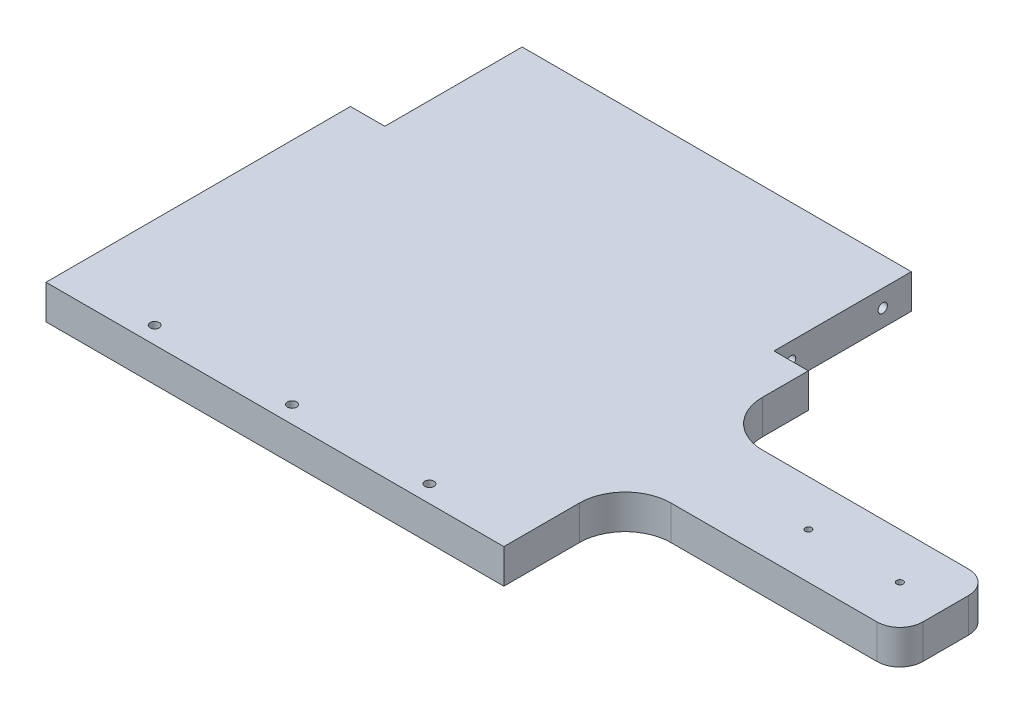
from build123d import *

# Parameters (mm, degrees)
SKETCH1_W                      = 254
SKETCH1_H                      = 245.11
SKETCH1_W_2                    = 152.4
SKETCH1_H_2                    = 50.8
BOSS_EXTRUDE1_DEPTH            = 19.05
SKETCH2_R                      = 1.778
CUT_EXTRUDE1_DEPTH             = 306.691004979
FILLET1_R                      = 25.4
FILLET2_R                      = 25.4
FILLET3_R                      = 12.7
FILLET4_R                      = 12.7
SKETCH3_W                      = 76.2
SKETCH3_H                      = 19.05
CUT_EXTRUDE2_DEPTH             = 19.05
F_10_CLEARANCE_HOLE1_D         = 5.1054
F_10_CLEARANCE_HOLE2_D         = 5.1054
SKETCH8_W                      = 76.2
SKETCH8_H                      = 19.05
CUT_EXTRUDE3_DEPTH             = 19.05
F_7_0_201_DIAMETER_HOLE5_D     = 5.1054
F_7_0_201_DIAMETER_HOLE5_DEPTH = 50.8
F_7_0_201_DIAMETER_HOLE5_TIP   = 1.533816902


with BuildPart() as part:
    # Sketch1 → Boss-Extrude1 (new body)
    with BuildSketch(Plane(origin=(0, 0, 0), x_dir=(1, 0, 0), z_dir=(0, 1, 0))):
        Rectangle(SKETCH1_W, SKETCH1_H)
        with Locations((203.2, -29.845)):
            Rectangle(SKETCH1_W_2, SKETCH1_H_2)
    extrude(amount=BOSS_EXTRUDE1_DEPTH)

    # Sketch2 → Cut-Extrude1 (cut, through all)
    with BuildSketch(Plane(origin=(0, 19.05, 0), x_dir=(1, 0, 0), z_dir=(0, 1, 0))):
        with Locations(Location((203.2, -29.845, 0), (0, 0, 270))):
            Circle(SKETCH2_R)
        with Locations(Location((254, -29.845, 0), (0, 0, 270))):
            Circle(SKETCH2_R)
    extrude(amount=-CUT_EXTRUDE1_DEPTH, mode=Mode.SUBTRACT)

    # Fillet1
    fillet1_edges = [part.edges().sort_by_distance(p)[0] for p in [
        (127, 9.525, 4.445),
    ]]
    fillet(fillet1_edges, radius=FILLET1_R)

    # Fillet2
    fillet2_edges = [part.edges().sort_by_distance(p)[0] for p in [
        (127, 9.525, 55.245),
    ]]
    fillet(fillet2_edges, radius=FILLET2_R)

    # Fillet3
    fillet3_edges = [part.edges().sort_by_distance(p)[0] for p in [
        (279.4, 9.525, 4.445),
    ]]
    fillet(fillet3_edges, radius=FILLET3_R)

    # Fillet4
    fillet4_edges = [part.edges().sort_by_distance(p)[0] for p in [
        (279.4, 9.525, 55.245),
    ]]
    fillet(fillet4_edges, radius=FILLET4_R)

    # Sketch3 → Cut-Extrude2 (cut)
    with BuildSketch(Plane.ZY.offset(127)):
        with Locations((-84.455, 9.525)):
            Rectangle(SKETCH3_W, SKETCH3_H)
    extrude(amount=-CUT_EXTRUDE2_DEPTH, mode=Mode.SUBTRACT)

    # 10 Clearance Hole1 (through all)
    with Locations(Plane(origin=(0, 19.05, 0), x_dir=(1, 0, 0), z_dir=(0, 1, 0))):
        with Locations((-76.2, -113.03)):
            f_10_clearance_hole1 = Hole(F_10_CLEARANCE_HOLE1_D / 2)

    # Mirror1: 10 Clearance Hole1 across plane
    add(f_10_clearance_hole1.mirror(Plane(origin=(0, 0, 0), x_dir=(0, 0, 1), z_dir=(1, 0, 0))), mode=Mode.SUBTRACT)

    # 10 Clearance Hole2 (through all)
    with Locations(Plane(origin=(0, 19.05, 0), x_dir=(1, 0, 0), z_dir=(0, 1, 0))):
        with Locations((0, -113.03)):
            Hole(F_10_CLEARANCE_HOLE2_D / 2)

    # Sketch8 → Cut-Extrude3 (cut)
    with BuildSketch(Plane(origin=(127, 0, 0), x_dir=(0, 0, -1), z_dir=(1, 0, 0))):
        with Locations((84.455, 9.525)):
            Rectangle(SKETCH8_W, SKETCH8_H)
    extrude(amount=-CUT_EXTRUDE3_DEPTH, mode=Mode.SUBTRACT)

    # Sketch9 → 7 _0.201_ Diameter Hole1 (revolve, cut)
    with BuildSketch(Plane(origin=(107.95, 9.525, -55.88), x_dir=(0, 0, -1), z_dir=(0, 1, 0))):
        Polygon((0, 0), (0, 52.333816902), (2.5527, 50.8), (2.5527, 0), align=None)
    f_7_0_201_diameter_hole1 = revolve(axis=Axis((114.3, 9.525, -55.88), (-1, 0, 0)), mode=Mode.SUBTRACT)

    # Sketch11 → 7 _0.201_ Diameter Hole2 (revolve, cut)
    with BuildSketch(Plane(origin=(107.95, 9.525, -106.68), x_dir=(0, 0, -1), z_dir=(0, 1, 0))):
        Polygon((0, 0), (0, 52.333816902), (2.5527, 50.8), (2.5527, 0), align=None)
    f_7_0_201_diameter_hole2 = revolve(axis=Axis((114.3, 9.525, -106.68), (-1, 0, 0)), mode=Mode.SUBTRACT)

    # Mirror2: 7 _0.201_ Diameter Hole1, 7 _0.201_ Diameter Hole2 across plane
    add(f_7_0_201_diameter_hole1.mirror(Plane(origin=(0, 0, 0), x_dir=(0, 0, 1), z_dir=(1, 0, 0))), mode=Mode.SUBTRACT)
    add(f_7_0_201_diameter_hole2.mirror(Plane(origin=(0, 0, 0), x_dir=(0, 0, 1), z_dir=(1, 0, 0))), mode=Mode.SUBTRACT)

    # Sketch13 → 7 _0.201_ Diameter Hole3 (revolve, cut)
    with BuildSketch(Plane(origin=(-63.5, 9.525, -122.555), x_dir=(0, 1, 0), z_dir=(1, 0, 0))):
        Polygon((0, 0), (0, 52.333816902), (2.5527, 50.8), (2.5527, 0), align=None)
    f_7_0_201_diameter_hole3 = revolve(axis=Axis((-63.5, 9.525, -128.905), (0, 0, 1)), mode=Mode.SUBTRACT)

    # Mirror3: 7 _0.201_ Diameter Hole3 across plane
    add(f_7_0_201_diameter_hole3.mirror(Plane(origin=(0, 0, 0), x_dir=(0, 0, 1), z_dir=(1, 0, 0))), mode=Mode.SUBTRACT)

    # 7 _0.201_ Diameter Hole5
    with Locations(Plane(origin=(0, 0, -122.555), x_dir=(-1, 0, 0), z_dir=(0, 0, -1))):
        with Locations((0, 9.525)):
            Hole(F_7_0_201_DIAMETER_HOLE5_D / 2, depth=F_7_0_201_DIAMETER_HOLE5_DEPTH)
            with Locations((0, 0, -(F_7_0_201_DIAMETER_HOLE5_DEPTH + F_7_0_201_DIAMETER_HOLE5_TIP / 2))):  # 118° drill point
                Cone(0, F_7_0_201_DIAMETER_HOLE5_D / 2, F_7_0_201_DIAMETER_HOLE5_TIP, mode=Mode.SUBTRACT)


solid = part.part
